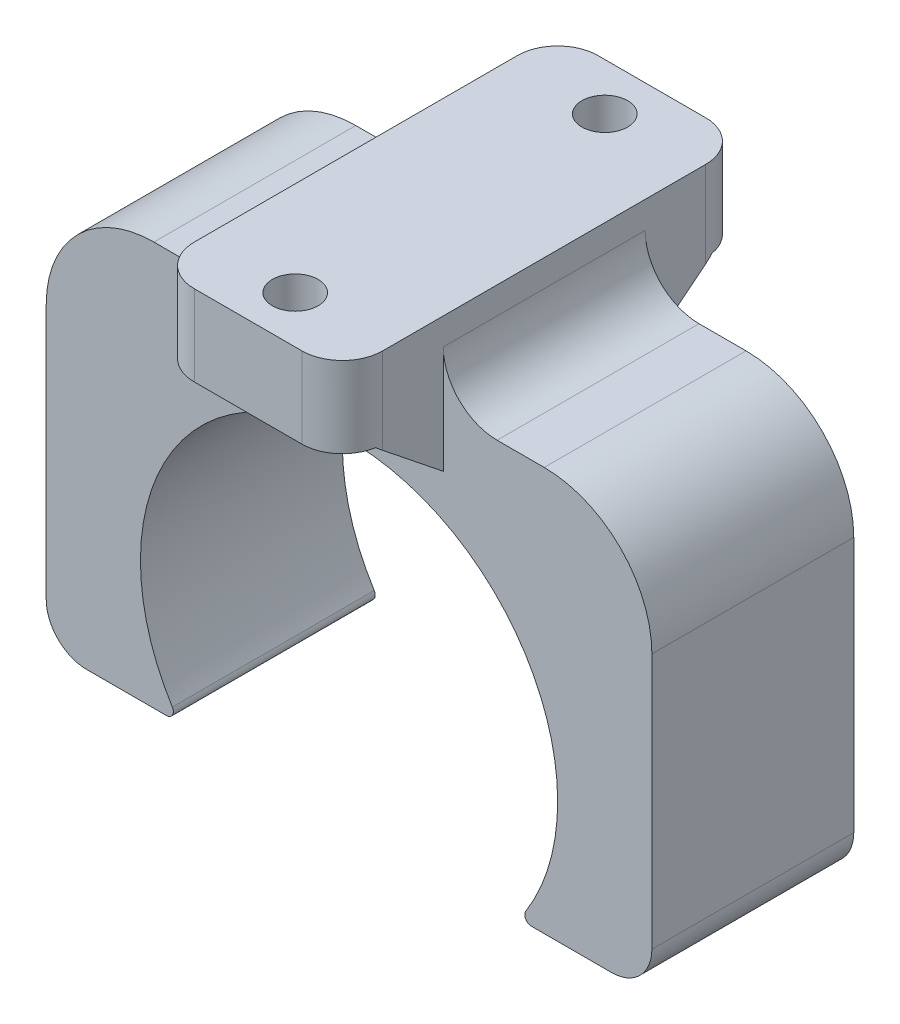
ISO-10303-21;
HEADER;
FILE_DESCRIPTION(('STEP AP214'),'2;1');
FILE_NAME('part.step','',(''),(''),'','','');
FILE_SCHEMA(('AUTOMOTIVE_DESIGN { 1 0 10303 214 1 1 1 1 }'));
ENDSEC;
DATA;
#1=APPLICATION_CONTEXT('core data for automotive mechanical design processes');
#2=APPLICATION_PROTOCOL_DEFINITION('international standard','automotive_design',2000,#1);
#3=PRODUCT_CONTEXT('',#1,'mechanical');
#4=PRODUCT('Part','Part','',(#3));
#5=PRODUCT_RELATED_PRODUCT_CATEGORY('part','',(#4));
#6=PRODUCT_DEFINITION_FORMATION('','',#4);
#7=PRODUCT_DEFINITION_CONTEXT('part definition',#1,'design');
#8=PRODUCT_DEFINITION('design','',#6,#7);
#9=PRODUCT_DEFINITION_SHAPE('','',#8);
#10=(LENGTH_UNIT() NAMED_UNIT(*) SI_UNIT(.MILLI.,.METRE.));
#11=(NAMED_UNIT(*) PLANE_ANGLE_UNIT() SI_UNIT($,.RADIAN.));
#12=(NAMED_UNIT(*) SI_UNIT($,.STERADIAN.) SOLID_ANGLE_UNIT());
#13=UNCERTAINTY_MEASURE_WITH_UNIT(LENGTH_MEASURE(1.E-05),#10,'distance_accuracy_value','');
#14=(GEOMETRIC_REPRESENTATION_CONTEXT(3) GLOBAL_UNCERTAINTY_ASSIGNED_CONTEXT((#13)) GLOBAL_UNIT_ASSIGNED_CONTEXT((#10,
#11,#12)) REPRESENTATION_CONTEXT('',''));
#15=CARTESIAN_POINT('',(0.,0.,0.));
#16=DIRECTION('',(0.,0.,1.));
#17=DIRECTION('',(1.,0.,0.));
#18=AXIS2_PLACEMENT_3D('',#15,#16,#17);
#19=CARTESIAN_POINT('',(-22.5,15.,7.5));
#20=DIRECTION('',(0.,-1.,0.));
#21=DIRECTION('',(0.,0.,-1.));
#22=AXIS2_PLACEMENT_3D('',#19,#20,#21);
#23=PLANE('',#22);
#24=DIRECTION('',(-1.,0.,0.));
#25=VECTOR('',#24,1.);
#26=CARTESIAN_POINT('',(-22.5,15.,-7.5));
#27=LINE('',#26,#25);
#28=CARTESIAN_POINT('',(14.5,15.,-7.5));
#29=VERTEX_POINT('',#28);
#30=CARTESIAN_POINT('',(11.,15.,-7.5));
#31=VERTEX_POINT('',#30);
#32=EDGE_CURVE('E410',#29,#31,#27,.T.);
#33=ORIENTED_EDGE('',*,*,#32,.T.);
#34=DIRECTION('',(0.,0.,-1.));
#35=VECTOR('',#34,1.);
#36=CARTESIAN_POINT('',(11.,15.,7.5));
#37=LINE('',#36,#35);
#38=CARTESIAN_POINT('',(11.,15.,7.5));
#39=VERTEX_POINT('',#38);
#40=EDGE_CURVE('E522',#31,#39,#37,.F.);
#41=ORIENTED_EDGE('',*,*,#40,.T.);
#42=DIRECTION('',(-1.,0.,0.));
#43=VECTOR('',#42,1.);
#44=CARTESIAN_POINT('',(-22.5,15.,7.5));
#45=LINE('',#44,#43);
#46=CARTESIAN_POINT('',(14.5,15.,7.5));
#47=VERTEX_POINT('',#46);
#48=EDGE_CURVE('E393',#47,#39,#45,.T.);
#49=ORIENTED_EDGE('',*,*,#48,.F.);
#50=DIRECTION('',(0.,0.,-1.));
#51=VECTOR('',#50,1.);
#52=CARTESIAN_POINT('',(14.5,15.,7.5));
#53=LINE('',#52,#51);
#54=EDGE_CURVE('E429',#47,#29,#53,.T.);
#55=ORIENTED_EDGE('',*,*,#54,.T.);
#56=EDGE_LOOP('',(#33,#41,#49,#55));
#57=FACE_BOUND('',#56,.T.);
#58=ADVANCED_FACE('F46',(#57),#23,.F.);
#59=CARTESIAN_POINT('',(-11.,15.,7.5));
#60=VERTEX_POINT('',#59);
#61=CARTESIAN_POINT('',(-14.5,15.,7.5));
#62=VERTEX_POINT('',#61);
#63=EDGE_CURVE('E391',#60,#62,#45,.T.);
#64=ORIENTED_EDGE('',*,*,#63,.F.);
#65=DIRECTION('',(0.,0.,1.));
#66=VECTOR('',#65,1.);
#67=CARTESIAN_POINT('',(-11.,15.,-7.5));
#68=LINE('',#67,#66);
#69=CARTESIAN_POINT('',(-11.,15.,-7.5));
#70=VERTEX_POINT('',#69);
#71=EDGE_CURVE('E535',#60,#70,#68,.F.);
#72=ORIENTED_EDGE('',*,*,#71,.T.);
#73=CARTESIAN_POINT('',(-14.5,15.,-7.5));
#74=VERTEX_POINT('',#73);
#75=EDGE_CURVE('E409',#70,#74,#27,.T.);
#76=ORIENTED_EDGE('',*,*,#75,.T.);
#77=DIRECTION('',(0.,0.,-1.));
#78=VECTOR('',#77,1.);
#79=CARTESIAN_POINT('',(-14.5,15.,7.5));
#80=LINE('',#79,#78);
#81=EDGE_CURVE('E425',#74,#62,#80,.F.);
#82=ORIENTED_EDGE('',*,*,#81,.T.);
#83=EDGE_LOOP('',(#64,#72,#76,#82));
#84=FACE_BOUND('',#83,.T.);
#85=ADVANCED_FACE('F683',(#84),#23,.F.);
#86=CARTESIAN_POINT('',(-22.5,-15.,7.5));
#87=DIRECTION('',(0.,1.,0.));
#88=DIRECTION('',(0.,0.,1.));
#89=AXIS2_PLACEMENT_3D('',#86,#87,#88);
#90=PLANE('',#89);
#91=DIRECTION('',(1.,0.,0.));
#92=VECTOR('',#91,1.);
#93=CARTESIAN_POINT('',(-22.5,-15.,-7.5));
#94=LINE('',#93,#92);
#95=CARTESIAN_POINT('',(-19.5,-15.,-7.5));
#96=VERTEX_POINT('',#95);
#97=CARTESIAN_POINT('',(-13.555441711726,-15.,-7.5));
#98=VERTEX_POINT('',#97);
#99=EDGE_CURVE('E392',#96,#98,#94,.T.);
#100=ORIENTED_EDGE('',*,*,#99,.T.);
#101=DIRECTION('',(0.,0.,1.));
#102=VECTOR('',#101,1.);
#103=CARTESIAN_POINT('',(-13.555441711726,-15.,7.5));
#104=LINE('',#103,#102);
#105=CARTESIAN_POINT('',(-13.555441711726,-15.,7.5));
#106=VERTEX_POINT('',#105);
#107=EDGE_CURVE('E483',#98,#106,#104,.T.);
#108=ORIENTED_EDGE('',*,*,#107,.T.);
#109=DIRECTION('',(1.,0.,0.));
#110=VECTOR('',#109,1.);
#111=CARTESIAN_POINT('',(-22.5,-15.,7.5));
#112=LINE('',#111,#110);
#113=CARTESIAN_POINT('',(-19.5,-15.,7.5));
#114=VERTEX_POINT('',#113);
#115=EDGE_CURVE('E402',#114,#106,#112,.T.);
#116=ORIENTED_EDGE('',*,*,#115,.F.);
#117=DIRECTION('',(0.,0.,-1.));
#118=VECTOR('',#117,1.);
#119=CARTESIAN_POINT('',(-19.5,-15.,7.5));
#120=LINE('',#119,#118);
#121=EDGE_CURVE('E476',#114,#96,#120,.T.);
#122=ORIENTED_EDGE('',*,*,#121,.T.);
#123=EDGE_LOOP('',(#100,#108,#116,#122));
#124=FACE_BOUND('',#123,.T.);
#125=ADVANCED_FACE('F702',(#124),#90,.F.);
#126=CARTESIAN_POINT('',(22.5,-15.,7.5));
#127=DIRECTION('',(-1.,0.,0.));
#128=DIRECTION('',(0.,0.,1.));
#129=AXIS2_PLACEMENT_3D('',#126,#127,#128);
#130=PLANE('',#129);
#131=DIRECTION('',(0.,1.,0.));
#132=VECTOR('',#131,1.);
#133=CARTESIAN_POINT('',(22.5,-15.,7.5));
#134=LINE('',#133,#132);
#135=CARTESIAN_POINT('',(22.5,-12.,7.5));
#136=VERTEX_POINT('',#135);
#137=CARTESIAN_POINT('',(22.5,7.,7.5));
#138=VERTEX_POINT('',#137);
#139=EDGE_CURVE('E388',#136,#138,#134,.T.);
#140=ORIENTED_EDGE('',*,*,#139,.F.);
#141=DIRECTION('',(0.,0.,-1.));
#142=VECTOR('',#141,1.);
#143=CARTESIAN_POINT('',(22.5,-12.,7.5));
#144=LINE('',#143,#142);
#145=CARTESIAN_POINT('',(22.5,-12.,-7.5));
#146=VERTEX_POINT('',#145);
#147=EDGE_CURVE('E455',#136,#146,#144,.T.);
#148=ORIENTED_EDGE('',*,*,#147,.T.);
#149=DIRECTION('',(0.,1.,0.));
#150=VECTOR('',#149,1.);
#151=CARTESIAN_POINT('',(22.5,-15.,-7.5));
#152=LINE('',#151,#150);
#153=CARTESIAN_POINT('',(22.5,7.,-7.5));
#154=VERTEX_POINT('',#153);
#155=EDGE_CURVE('E387',#146,#154,#152,.T.);
#156=ORIENTED_EDGE('',*,*,#155,.T.);
#157=DIRECTION('',(0.,0.,-1.));
#158=VECTOR('',#157,1.);
#159=CARTESIAN_POINT('',(22.5,7.,7.5));
#160=LINE('',#159,#158);
#161=EDGE_CURVE('E441',#154,#138,#160,.F.);
#162=ORIENTED_EDGE('',*,*,#161,.T.);
#163=EDGE_LOOP('',(#140,#148,#156,#162));
#164=FACE_BOUND('',#163,.T.);
#165=ADVANCED_FACE('F732',(#164),#130,.F.);
#166=CARTESIAN_POINT('',(-22.5,-15.,7.5));
#167=DIRECTION('',(1.,0.,0.));
#168=DIRECTION('',(0.,0.,-1.));
#169=AXIS2_PLACEMENT_3D('',#166,#167,#168);
#170=PLANE('',#169);
#171=DIRECTION('',(0.,-1.,0.));
#172=VECTOR('',#171,1.);
#173=CARTESIAN_POINT('',(-22.5,-15.,-7.5));
#174=LINE('',#173,#172);
#175=CARTESIAN_POINT('',(-22.5,7.,-7.5));
#176=VERTEX_POINT('',#175);
#177=CARTESIAN_POINT('',(-22.5,-12.,-7.5));
#178=VERTEX_POINT('',#177);
#179=EDGE_CURVE('E414',#176,#178,#174,.T.);
#180=ORIENTED_EDGE('',*,*,#179,.T.);
#181=DIRECTION('',(0.,0.,-1.));
#182=VECTOR('',#181,1.);
#183=CARTESIAN_POINT('',(-22.5,-12.,7.5));
#184=LINE('',#183,#182);
#185=CARTESIAN_POINT('',(-22.5,-12.,7.5));
#186=VERTEX_POINT('',#185);
#187=EDGE_CURVE('E480',#178,#186,#184,.F.);
#188=ORIENTED_EDGE('',*,*,#187,.T.);
#189=DIRECTION('',(0.,-1.,0.));
#190=VECTOR('',#189,1.);
#191=CARTESIAN_POINT('',(-22.5,-15.,7.5));
#192=LINE('',#191,#190);
#193=CARTESIAN_POINT('',(-22.5,7.,7.5));
#194=VERTEX_POINT('',#193);
#195=EDGE_CURVE('E397',#194,#186,#192,.T.);
#196=ORIENTED_EDGE('',*,*,#195,.F.);
#197=DIRECTION('',(0.,0.,-1.));
#198=VECTOR('',#197,1.);
#199=CARTESIAN_POINT('',(-22.5,7.,7.5));
#200=LINE('',#199,#198);
#201=EDGE_CURVE('E451',#194,#176,#200,.T.);
#202=ORIENTED_EDGE('',*,*,#201,.T.);
#203=EDGE_LOOP('',(#180,#188,#196,#202));
#204=FACE_BOUND('',#203,.T.);
#205=ADVANCED_FACE('F695',(#204),#170,.F.);
#206=CARTESIAN_POINT('',(13.5554417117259,-15.,7.5));
#207=VERTEX_POINT('',#206);
#208=CARTESIAN_POINT('',(19.5,-15.,7.5));
#209=VERTEX_POINT('',#208);
#210=EDGE_CURVE('E401',#207,#209,#112,.T.);
#211=ORIENTED_EDGE('',*,*,#210,.F.);
#212=DIRECTION('',(0.,0.,1.));
#213=VECTOR('',#212,1.);
#214=CARTESIAN_POINT('',(13.555441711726,-15.,7.5));
#215=LINE('',#214,#213);
#216=CARTESIAN_POINT('',(13.5554417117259,-15.,-7.5));
#217=VERTEX_POINT('',#216);
#218=EDGE_CURVE('E507',#207,#217,#215,.F.);
#219=ORIENTED_EDGE('',*,*,#218,.T.);
#220=CARTESIAN_POINT('',(19.5,-15.,-7.5));
#221=VERTEX_POINT('',#220);
#222=EDGE_CURVE('E419',#217,#221,#94,.T.);
#223=ORIENTED_EDGE('',*,*,#222,.T.);
#224=DIRECTION('',(0.,0.,-1.));
#225=VECTOR('',#224,1.);
#226=CARTESIAN_POINT('',(19.5,-15.,7.5));
#227=LINE('',#226,#225);
#228=EDGE_CURVE('E466',#221,#209,#227,.F.);
#229=ORIENTED_EDGE('',*,*,#228,.T.);
#230=EDGE_LOOP('',(#211,#219,#223,#229));
#231=FACE_BOUND('',#230,.T.);
#232=ADVANCED_FACE('F719',(#231),#90,.F.);
#233=CARTESIAN_POINT('',(0.,0.,7.5));
#234=DIRECTION('',(0.,0.,-1.));
#235=DIRECTION('',(-1.,0.,0.));
#236=AXIS2_PLACEMENT_3D('',#233,#234,#235);
#237=PLANE('',#236);
#238=CARTESIAN_POINT('',(-13.555441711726,-14.5,7.5));
#239=DIRECTION('',(0.,0.,-1.));
#240=DIRECTION('',(-1.,0.,0.));
#241=AXIS2_PLACEMENT_3D('',#238,#239,#240);
#242=CIRCLE('',#241,0.5);
#243=CARTESIAN_POINT('',(-13.1318341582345,-14.234375,7.5));
#244=VERTEX_POINT('',#243);
#245=EDGE_CURVE('E490',#106,#244,#242,.F.);
#246=ORIENTED_EDGE('',*,*,#245,.T.);
#247=CARTESIAN_POINT('',(0.,-6.,7.5));
#248=DIRECTION('',(0.,0.,1.));
#249=DIRECTION('',(1.,0.,0.));
#250=AXIS2_PLACEMENT_3D('',#247,#248,#249);
#251=CIRCLE('',#250,15.5);
#252=CARTESIAN_POINT('',(13.1318341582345,-14.234375,7.5));
#253=VERTEX_POINT('',#252);
#254=EDGE_CURVE('E384',#253,#244,#251,.T.);
#255=ORIENTED_EDGE('',*,*,#254,.F.);
#256=CARTESIAN_POINT('',(13.555441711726,-14.5,7.5));
#257=DIRECTION('',(0.,0.,-1.));
#258=DIRECTION('',(-1.,0.,0.));
#259=AXIS2_PLACEMENT_3D('',#256,#257,#258);
#260=CIRCLE('',#259,0.5);
#261=EDGE_CURVE('E487',#253,#207,#260,.F.);
#262=ORIENTED_EDGE('',*,*,#261,.T.);
#263=ORIENTED_EDGE('',*,*,#210,.T.);
#264=CARTESIAN_POINT('',(19.5,-12.,7.5));
#265=DIRECTION('',(0.,0.,-1.));
#266=DIRECTION('',(-1.,0.,0.));
#267=AXIS2_PLACEMENT_3D('',#264,#265,#266);
#268=CIRCLE('',#267,3.);
#269=EDGE_CURVE('E473',#209,#136,#268,.F.);
#270=ORIENTED_EDGE('',*,*,#269,.T.);
#271=ORIENTED_EDGE('',*,*,#139,.T.);
#272=CARTESIAN_POINT('',(14.5,7.,7.5));
#273=DIRECTION('',(0.,0.,-1.));
#274=DIRECTION('',(-1.,0.,0.));
#275=AXIS2_PLACEMENT_3D('',#272,#273,#274);
#276=CIRCLE('',#275,8.);
#277=EDGE_CURVE('E448',#138,#47,#276,.F.);
#278=ORIENTED_EDGE('',*,*,#277,.T.);
#279=ORIENTED_EDGE('',*,*,#48,.T.);
#280=CARTESIAN_POINT('',(11.,19.,7.5));
#281=DIRECTION('',(0.,0.,-1.));
#282=DIRECTION('',(-1.,0.,0.));
#283=AXIS2_PLACEMENT_3D('',#280,#281,#282);
#284=CIRCLE('',#283,4.);
#285=CARTESIAN_POINT('',(7.,19.,7.5));
#286=VERTEX_POINT('',#285);
#287=EDGE_CURVE('E541',#39,#286,#284,.T.);
#288=ORIENTED_EDGE('',*,*,#287,.T.);
#289=DIRECTION('',(0.,1.,0.));
#290=VECTOR('',#289,1.);
#291=CARTESIAN_POINT('',(7.,0.,7.5));
#292=LINE('',#291,#290);
#293=CARTESIAN_POINT('',(7.,11.,7.5));
#294=VERTEX_POINT('',#293);
#295=EDGE_CURVE('E511',#294,#286,#292,.T.);
#296=ORIENTED_EDGE('',*,*,#295,.F.);
#297=DIRECTION('',(-1.,0.,0.));
#298=VECTOR('',#297,1.);
#299=CARTESIAN_POINT('',(0.,11.,7.5));
#300=LINE('',#299,#298);
#301=CARTESIAN_POINT('',(5.,11.,7.5));
#302=VERTEX_POINT('',#301);
#303=EDGE_CURVE('E352',#294,#302,#300,.T.);
#304=ORIENTED_EDGE('',*,*,#303,.T.);
#305=DIRECTION('',(0.,-1.,0.));
#306=VECTOR('',#305,1.);
#307=CARTESIAN_POINT('',(5.,0.,7.5));
#308=LINE('',#307,#306);
#309=CARTESIAN_POINT('',(5.,15.,7.5));
#310=VERTEX_POINT('',#309);
#311=EDGE_CURVE('E346',#310,#302,#308,.T.);
#312=ORIENTED_EDGE('',*,*,#311,.F.);
#313=DIRECTION('',(-1.,0.,0.));
#314=VECTOR('',#313,1.);
#315=CARTESIAN_POINT('',(0.,15.,7.5));
#316=LINE('',#315,#314);
#317=CARTESIAN_POINT('',(-5.,15.,7.5));
#318=VERTEX_POINT('',#317);
#319=EDGE_CURVE('E374',#310,#318,#316,.T.);
#320=ORIENTED_EDGE('',*,*,#319,.T.);
#321=DIRECTION('',(0.,1.,0.));
#322=VECTOR('',#321,1.);
#323=CARTESIAN_POINT('',(-5.,0.,7.5));
#324=LINE('',#323,#322);
#325=CARTESIAN_POINT('',(-5.,11.,7.5));
#326=VERTEX_POINT('',#325);
#327=EDGE_CURVE('E306',#326,#318,#324,.T.);
#328=ORIENTED_EDGE('',*,*,#327,.F.);
#329=DIRECTION('',(1.,0.,0.));
#330=VECTOR('',#329,1.);
#331=CARTESIAN_POINT('',(0.,11.,7.5));
#332=LINE('',#331,#330);
#333=CARTESIAN_POINT('',(-7.,11.,7.5));
#334=VERTEX_POINT('',#333);
#335=EDGE_CURVE('E313',#326,#334,#332,.F.);
#336=ORIENTED_EDGE('',*,*,#335,.T.);
#337=DIRECTION('',(0.,-1.,0.));
#338=VECTOR('',#337,1.);
#339=CARTESIAN_POINT('',(-7.,0.,7.5));
#340=LINE('',#339,#338);
#341=CARTESIAN_POINT('',(-7.,19.,7.5));
#342=VERTEX_POINT('',#341);
#343=EDGE_CURVE('E531',#342,#334,#340,.T.);
#344=ORIENTED_EDGE('',*,*,#343,.F.);
#345=CARTESIAN_POINT('',(-11.,19.,7.5));
#346=DIRECTION('',(0.,0.,-1.));
#347=DIRECTION('',(-1.,0.,0.));
#348=AXIS2_PLACEMENT_3D('',#345,#346,#347);
#349=CIRCLE('',#348,4.);
#350=EDGE_CURVE('E545',#342,#60,#349,.T.);
#351=ORIENTED_EDGE('',*,*,#350,.T.);
#352=ORIENTED_EDGE('',*,*,#63,.T.);
#353=CARTESIAN_POINT('',(-14.5,7.,7.5));
#354=DIRECTION('',(0.,0.,-1.));
#355=DIRECTION('',(-1.,0.,0.));
#356=AXIS2_PLACEMENT_3D('',#353,#354,#355);
#357=CIRCLE('',#356,8.);
#358=EDGE_CURVE('E445',#62,#194,#357,.F.);
#359=ORIENTED_EDGE('',*,*,#358,.T.);
#360=ORIENTED_EDGE('',*,*,#195,.T.);
#361=CARTESIAN_POINT('',(-19.5,-12.,7.5));
#362=DIRECTION('',(0.,0.,-1.));
#363=DIRECTION('',(-1.,0.,0.));
#364=AXIS2_PLACEMENT_3D('',#361,#362,#363);
#365=CIRCLE('',#364,3.);
#366=EDGE_CURVE('E470',#186,#114,#365,.F.);
#367=ORIENTED_EDGE('',*,*,#366,.T.);
#368=ORIENTED_EDGE('',*,*,#115,.T.);
#369=EDGE_LOOP('',(#246,#255,#262,#263,#270,#271,#278,#279,#288,#296,#304,#312,#320,#328,#336,
#344,#351,#352,#359,#360,#367,#368));
#370=FACE_BOUND('',#369,.T.);
#371=ADVANCED_FACE('F667',(#370),#237,.F.);
#372=CARTESIAN_POINT('',(0.,0.,-7.5));
#373=DIRECTION('',(0.,0.,-1.));
#374=DIRECTION('',(-1.,0.,0.));
#375=AXIS2_PLACEMENT_3D('',#372,#373,#374);
#376=PLANE('',#375);
#377=DIRECTION('',(0.,1.,0.));
#378=VECTOR('',#377,1.);
#379=CARTESIAN_POINT('',(-7.,21.,-7.5));
#380=LINE('',#379,#378);
#381=CARTESIAN_POINT('',(-7.,11.,-7.5));
#382=VERTEX_POINT('',#381);
#383=CARTESIAN_POINT('',(-7.,19.,-7.5));
#384=VERTEX_POINT('',#383);
#385=EDGE_CURVE('E290',#382,#384,#380,.T.);
#386=ORIENTED_EDGE('',*,*,#385,.F.);
#387=DIRECTION('',(-1.,0.,0.));
#388=VECTOR('',#387,1.);
#389=CARTESIAN_POINT('',(0.,11.,-7.5));
#390=LINE('',#389,#388);
#391=CARTESIAN_POINT('',(-5.,11.,-7.5));
#392=VERTEX_POINT('',#391);
#393=EDGE_CURVE('E278',#392,#382,#390,.T.);
#394=ORIENTED_EDGE('',*,*,#393,.F.);
#395=DIRECTION('',(0.,1.,0.));
#396=VECTOR('',#395,1.);
#397=CARTESIAN_POINT('',(-5.,0.,-7.5));
#398=LINE('',#397,#396);
#399=CARTESIAN_POINT('',(-5.,15.,-7.5));
#400=VERTEX_POINT('',#399);
#401=EDGE_CURVE('E267',#392,#400,#398,.T.);
#402=ORIENTED_EDGE('',*,*,#401,.T.);
#403=CARTESIAN_POINT('',(4.99999999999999,15.,-7.5));
#404=VERTEX_POINT('',#403);
#405=EDGE_CURVE('E415',#404,#400,#27,.T.);
#406=ORIENTED_EDGE('',*,*,#405,.F.);
#407=DIRECTION('',(0.,-1.,0.));
#408=VECTOR('',#407,1.);
#409=CARTESIAN_POINT('',(5.,0.,-7.5));
#410=LINE('',#409,#408);
#411=CARTESIAN_POINT('',(5.,11.,-7.5));
#412=VERTEX_POINT('',#411);
#413=EDGE_CURVE('E328',#404,#412,#410,.T.);
#414=ORIENTED_EDGE('',*,*,#413,.T.);
#415=DIRECTION('',(1.,0.,0.));
#416=VECTOR('',#415,1.);
#417=CARTESIAN_POINT('',(0.,11.,-7.5));
#418=LINE('',#417,#416);
#419=CARTESIAN_POINT('',(7.,11.,-7.5));
#420=VERTEX_POINT('',#419);
#421=EDGE_CURVE('E332',#420,#412,#418,.F.);
#422=ORIENTED_EDGE('',*,*,#421,.F.);
#423=DIRECTION('',(0.,-1.,0.));
#424=VECTOR('',#423,1.);
#425=CARTESIAN_POINT('',(7.,21.,-7.5));
#426=LINE('',#425,#424);
#427=CARTESIAN_POINT('',(7.,19.,-7.5));
#428=VERTEX_POINT('',#427);
#429=EDGE_CURVE('E518',#428,#420,#426,.T.);
#430=ORIENTED_EDGE('',*,*,#429,.F.);
#431=CARTESIAN_POINT('',(11.,19.,-7.5));
#432=DIRECTION('',(0.,0.,-1.));
#433=DIRECTION('',(-1.,0.,0.));
#434=AXIS2_PLACEMENT_3D('',#431,#432,#433);
#435=CIRCLE('',#434,4.);
#436=EDGE_CURVE('E538',#428,#31,#435,.F.);
#437=ORIENTED_EDGE('',*,*,#436,.T.);
#438=ORIENTED_EDGE('',*,*,#32,.F.);
#439=CARTESIAN_POINT('',(14.5,7.,-7.5));
#440=DIRECTION('',(0.,0.,-1.));
#441=DIRECTION('',(-1.,0.,0.));
#442=AXIS2_PLACEMENT_3D('',#439,#440,#441);
#443=CIRCLE('',#442,8.);
#444=EDGE_CURVE('E437',#29,#154,#443,.T.);
#445=ORIENTED_EDGE('',*,*,#444,.T.);
#446=ORIENTED_EDGE('',*,*,#155,.F.);
#447=CARTESIAN_POINT('',(19.5,-12.,-7.5));
#448=DIRECTION('',(0.,0.,-1.));
#449=DIRECTION('',(-1.,0.,0.));
#450=AXIS2_PLACEMENT_3D('',#447,#448,#449);
#451=CIRCLE('',#450,3.);
#452=EDGE_CURVE('E462',#146,#221,#451,.T.);
#453=ORIENTED_EDGE('',*,*,#452,.T.);
#454=ORIENTED_EDGE('',*,*,#222,.F.);
#455=CARTESIAN_POINT('',(13.555441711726,-14.5,-7.5));
#456=DIRECTION('',(0.,0.,-1.));
#457=DIRECTION('',(-1.,0.,0.));
#458=AXIS2_PLACEMENT_3D('',#455,#456,#457);
#459=CIRCLE('',#458,0.5);
#460=CARTESIAN_POINT('',(13.1318341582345,-14.234375,-7.5));
#461=VERTEX_POINT('',#460);
#462=EDGE_CURVE('E500',#217,#461,#459,.T.);
#463=ORIENTED_EDGE('',*,*,#462,.T.);
#464=CARTESIAN_POINT('',(0.,-6.,-7.5));
#465=DIRECTION('',(0.,0.,-1.));
#466=DIRECTION('',(-1.,0.,0.));
#467=AXIS2_PLACEMENT_3D('',#464,#465,#466);
#468=CIRCLE('',#467,15.5);
#469=CARTESIAN_POINT('',(-13.1318341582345,-14.234375,-7.5));
#470=VERTEX_POINT('',#469);
#471=EDGE_CURVE('E406',#470,#461,#468,.T.);
#472=ORIENTED_EDGE('',*,*,#471,.F.);
#473=CARTESIAN_POINT('',(-13.555441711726,-14.5,-7.5));
#474=DIRECTION('',(0.,0.,-1.));
#475=DIRECTION('',(-1.,0.,0.));
#476=AXIS2_PLACEMENT_3D('',#473,#474,#475);
#477=CIRCLE('',#476,0.5);
#478=EDGE_CURVE('E504',#470,#98,#477,.T.);
#479=ORIENTED_EDGE('',*,*,#478,.T.);
#480=ORIENTED_EDGE('',*,*,#99,.F.);
#481=CARTESIAN_POINT('',(-19.5,-12.,-7.5));
#482=DIRECTION('',(0.,0.,-1.));
#483=DIRECTION('',(-1.,0.,0.));
#484=AXIS2_PLACEMENT_3D('',#481,#482,#483);
#485=CIRCLE('',#484,3.);
#486=EDGE_CURVE('E459',#96,#178,#485,.T.);
#487=ORIENTED_EDGE('',*,*,#486,.T.);
#488=ORIENTED_EDGE('',*,*,#179,.F.);
#489=CARTESIAN_POINT('',(-14.5,7.,-7.5));
#490=DIRECTION('',(0.,0.,-1.));
#491=DIRECTION('',(-1.,0.,0.));
#492=AXIS2_PLACEMENT_3D('',#489,#490,#491);
#493=CIRCLE('',#492,8.);
#494=EDGE_CURVE('E433',#176,#74,#493,.T.);
#495=ORIENTED_EDGE('',*,*,#494,.T.);
#496=ORIENTED_EDGE('',*,*,#75,.F.);
#497=CARTESIAN_POINT('',(-11.,19.,-7.5));
#498=DIRECTION('',(0.,0.,-1.));
#499=DIRECTION('',(-1.,0.,0.));
#500=AXIS2_PLACEMENT_3D('',#497,#498,#499);
#501=CIRCLE('',#500,4.);
#502=EDGE_CURVE('E548',#70,#384,#501,.F.);
#503=ORIENTED_EDGE('',*,*,#502,.T.);
#504=EDGE_LOOP('',(#386,#394,#402,#406,#414,#422,#430,#437,#438,#445,#446,#453,#454,#463,#472,
#479,#480,#487,#488,#495,#496,#503));
#505=FACE_BOUND('',#504,.T.);
#506=ADVANCED_FACE('F288',(#505),#376,.T.);
#507=CARTESIAN_POINT('',(0.,-6.,-51.3406204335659));
#508=DIRECTION('',(0.,0.,1.));
#509=DIRECTION('',(1.,0.,0.));
#510=AXIS2_PLACEMENT_3D('',#507,#508,#509);
#511=CYLINDRICAL_SURFACE('',#510,15.5);
#512=ORIENTED_EDGE('',*,*,#254,.T.);
#513=DIRECTION('',(0.,0.,1.));
#514=VECTOR('',#513,1.);
#515=CARTESIAN_POINT('',(-13.1318341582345,-14.234375,-51.3406204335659));
#516=LINE('',#515,#514);
#517=EDGE_CURVE('E497',#244,#470,#516,.F.);
#518=ORIENTED_EDGE('',*,*,#517,.T.);
#519=ORIENTED_EDGE('',*,*,#471,.T.);
#520=DIRECTION('',(0.,0.,1.));
#521=VECTOR('',#520,1.);
#522=CARTESIAN_POINT('',(13.1318341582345,-14.234375,-51.3406204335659));
#523=LINE('',#522,#521);
#524=EDGE_CURVE('E494',#461,#253,#523,.T.);
#525=ORIENTED_EDGE('',*,*,#524,.T.);
#526=EDGE_LOOP('',(#512,#518,#519,#525));
#527=FACE_BOUND('',#526,.T.);
#528=ADVANCED_FACE('F752',(#527),#511,.F.);
#529=CARTESIAN_POINT('',(14.5,7.,7.5));
#530=DIRECTION('',(0.,0.,-1.));
#531=DIRECTION('',(-1.,0.,0.));
#532=AXIS2_PLACEMENT_3D('',#529,#530,#531);
#533=CYLINDRICAL_SURFACE('',#532,8.);
#534=ORIENTED_EDGE('',*,*,#277,.F.);
#535=ORIENTED_EDGE('',*,*,#161,.F.);
#536=ORIENTED_EDGE('',*,*,#444,.F.);
#537=ORIENTED_EDGE('',*,*,#54,.F.);
#538=EDGE_LOOP('',(#534,#535,#536,#537));
#539=FACE_BOUND('',#538,.T.);
#540=ADVANCED_FACE('F737',(#539),#533,.T.);
#541=CARTESIAN_POINT('',(-14.5,7.,7.5));
#542=DIRECTION('',(0.,0.,-1.));
#543=DIRECTION('',(-1.,0.,0.));
#544=AXIS2_PLACEMENT_3D('',#541,#542,#543);
#545=CYLINDRICAL_SURFACE('',#544,8.);
#546=ORIENTED_EDGE('',*,*,#358,.F.);
#547=ORIENTED_EDGE('',*,*,#81,.F.);
#548=ORIENTED_EDGE('',*,*,#494,.F.);
#549=ORIENTED_EDGE('',*,*,#201,.F.);
#550=EDGE_LOOP('',(#546,#547,#548,#549));
#551=FACE_BOUND('',#550,.T.);
#552=ADVANCED_FACE('F691',(#551),#545,.T.);
#553=CARTESIAN_POINT('',(19.5,-12.,7.5));
#554=DIRECTION('',(0.,0.,-1.));
#555=DIRECTION('',(-1.,0.,0.));
#556=AXIS2_PLACEMENT_3D('',#553,#554,#555);
#557=CYLINDRICAL_SURFACE('',#556,3.);
#558=ORIENTED_EDGE('',*,*,#269,.F.);
#559=ORIENTED_EDGE('',*,*,#228,.F.);
#560=ORIENTED_EDGE('',*,*,#452,.F.);
#561=ORIENTED_EDGE('',*,*,#147,.F.);
#562=EDGE_LOOP('',(#558,#559,#560,#561));
#563=FACE_BOUND('',#562,.T.);
#564=ADVANCED_FACE('F730',(#563),#557,.T.);
#565=CARTESIAN_POINT('',(-19.5,-12.,7.5));
#566=DIRECTION('',(0.,0.,-1.));
#567=DIRECTION('',(-1.,0.,0.));
#568=AXIS2_PLACEMENT_3D('',#565,#566,#567);
#569=CYLINDRICAL_SURFACE('',#568,3.);
#570=ORIENTED_EDGE('',*,*,#366,.F.);
#571=ORIENTED_EDGE('',*,*,#187,.F.);
#572=ORIENTED_EDGE('',*,*,#486,.F.);
#573=ORIENTED_EDGE('',*,*,#121,.F.);
#574=EDGE_LOOP('',(#570,#571,#572,#573));
#575=FACE_BOUND('',#574,.T.);
#576=ADVANCED_FACE('F698',(#575),#569,.T.);
#577=CARTESIAN_POINT('',(-13.555441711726,-14.5,-51.3406204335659));
#578=DIRECTION('',(0.,0.,1.));
#579=DIRECTION('',(1.,0.,0.));
#580=AXIS2_PLACEMENT_3D('',#577,#578,#579);
#581=CYLINDRICAL_SURFACE('',#580,0.5);
#582=ORIENTED_EDGE('',*,*,#478,.F.);
#583=ORIENTED_EDGE('',*,*,#517,.F.);
#584=ORIENTED_EDGE('',*,*,#245,.F.);
#585=ORIENTED_EDGE('',*,*,#107,.F.);
#586=EDGE_LOOP('',(#582,#583,#584,#585));
#587=FACE_BOUND('',#586,.T.);
#588=ADVANCED_FACE('F707',(#587),#581,.T.);
#589=CARTESIAN_POINT('',(13.555441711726,-14.5,-51.3406204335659));
#590=DIRECTION('',(0.,0.,1.));
#591=DIRECTION('',(1.,0.,0.));
#592=AXIS2_PLACEMENT_3D('',#589,#590,#591);
#593=CYLINDRICAL_SURFACE('',#592,0.5);
#594=ORIENTED_EDGE('',*,*,#261,.F.);
#595=ORIENTED_EDGE('',*,*,#524,.F.);
#596=ORIENTED_EDGE('',*,*,#462,.F.);
#597=ORIENTED_EDGE('',*,*,#218,.F.);
#598=EDGE_LOOP('',(#594,#595,#596,#597));
#599=FACE_BOUND('',#598,.T.);
#600=ADVANCED_FACE('F716',(#599),#593,.T.);
#601=CARTESIAN_POINT('',(0.,15.,0.));
#602=DIRECTION('',(0.,-1.,0.));
#603=DIRECTION('',(0.,0.,-1.));
#604=AXIS2_PLACEMENT_3D('',#601,#602,#603);
#605=PLANE('',#604);
#606=CARTESIAN_POINT('',(0.,15.,11.5));
#607=DIRECTION('',(0.,-1.,0.));
#608=DIRECTION('',(0.,0.,-1.));
#609=AXIS2_PLACEMENT_3D('',#606,#607,#608);
#610=CIRCLE('',#609,1.7);
#611=CARTESIAN_POINT('',(0.,15.,9.8));
#612=VERTEX_POINT('',#611);
#613=EDGE_CURVE('E1158',#612,#612,#610,.T.);
#614=ORIENTED_EDGE('',*,*,#613,.F.);
#615=EDGE_LOOP('',(#614));
#616=FACE_BOUND('',#615,.T.);
#617=DIRECTION('',(-1.,0.,0.));
#618=VECTOR('',#617,1.);
#619=CARTESIAN_POINT('',(0.,15.,12.5));
#620=LINE('',#619,#618);
#621=CARTESIAN_POINT('',(6.95803989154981,15.,12.5));
#622=VERTEX_POINT('',#621);
#623=CARTESIAN_POINT('',(5.,15.,12.5));
#624=VERTEX_POINT('',#623);
#625=EDGE_CURVE('E349',#622,#624,#620,.T.);
#626=ORIENTED_EDGE('',*,*,#625,.F.);
#627=CARTESIAN_POINT('',(4.,15.,12.));
#628=DIRECTION('',(0.,-1.,0.));
#629=DIRECTION('',(0.,0.,-1.));
#630=AXIS2_PLACEMENT_3D('',#627,#628,#629);
#631=CIRCLE('',#630,3.);
#632=CARTESIAN_POINT('',(4.,15.,15.));
#633=VERTEX_POINT('',#632);
#634=EDGE_CURVE('E569',#622,#633,#631,.T.);
#635=ORIENTED_EDGE('',*,*,#634,.T.);
#636=DIRECTION('',(1.,0.,0.));
#637=VECTOR('',#636,1.);
#638=CARTESIAN_POINT('',(-7.,15.,15.));
#639=LINE('',#638,#637);
#640=CARTESIAN_POINT('',(-4.,15.,15.));
#641=VERTEX_POINT('',#640);
#642=EDGE_CURVE('E362',#641,#633,#639,.T.);
#643=ORIENTED_EDGE('',*,*,#642,.F.);
#644=CARTESIAN_POINT('',(-4.,15.,12.));
#645=DIRECTION('',(0.,-1.,0.));
#646=DIRECTION('',(0.,0.,-1.));
#647=AXIS2_PLACEMENT_3D('',#644,#645,#646);
#648=CIRCLE('',#647,3.);
#649=CARTESIAN_POINT('',(-6.95803989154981,15.,12.5));
#650=VERTEX_POINT('',#649);
#651=EDGE_CURVE('E566',#641,#650,#648,.T.);
#652=ORIENTED_EDGE('',*,*,#651,.T.);
#653=DIRECTION('',(1.,0.,0.));
#654=VECTOR('',#653,1.);
#655=CARTESIAN_POINT('',(0.,15.,12.5));
#656=LINE('',#655,#654);
#657=CARTESIAN_POINT('',(-5.,15.,12.5));
#658=VERTEX_POINT('',#657);
#659=EDGE_CURVE('E309',#658,#650,#656,.F.);
#660=ORIENTED_EDGE('',*,*,#659,.F.);
#661=DIRECTION('',(0.,0.,-1.));
#662=VECTOR('',#661,1.);
#663=CARTESIAN_POINT('',(-5.,15.,0.));
#664=LINE('',#663,#662);
#665=EDGE_CURVE('E301',#658,#318,#664,.T.);
#666=ORIENTED_EDGE('',*,*,#665,.T.);
#667=ORIENTED_EDGE('',*,*,#319,.F.);
#668=DIRECTION('',(0.,0.,1.));
#669=VECTOR('',#668,1.);
#670=CARTESIAN_POINT('',(5.,15.,0.));
#671=LINE('',#670,#669);
#672=EDGE_CURVE('E339',#310,#624,#671,.T.);
#673=ORIENTED_EDGE('',*,*,#672,.T.);
#674=EDGE_LOOP('',(#626,#635,#643,#652,#660,#666,#667,#673));
#675=FACE_BOUND('',#674,.T.);
#676=ADVANCED_FACE('F763',(#616,#675),#605,.T.);
#677=CARTESIAN_POINT('',(7.,21.,15.));
#678=DIRECTION('',(-1.,0.,0.));
#679=DIRECTION('',(0.,0.,1.));
#680=AXIS2_PLACEMENT_3D('',#677,#678,#679);
#681=PLANE('',#680);
#682=DIRECTION('',(0.,0.,-1.));
#683=VECTOR('',#682,1.);
#684=CARTESIAN_POINT('',(7.,21.,15.));
#685=LINE('',#684,#683);
#686=CARTESIAN_POINT('',(7.,21.,12.));
#687=VERTEX_POINT('',#686);
#688=CARTESIAN_POINT('',(7.,21.,-12.));
#689=VERTEX_POINT('',#688);
#690=EDGE_CURVE('E357',#687,#689,#685,.T.);
#691=ORIENTED_EDGE('',*,*,#690,.F.);
#692=DIRECTION('',(0.,-1.,0.));
#693=VECTOR('',#692,1.);
#694=CARTESIAN_POINT('',(7.,21.,12.));
#695=LINE('',#694,#693);
#696=CARTESIAN_POINT('',(7.,14.6,12.));
#697=VERTEX_POINT('',#696);
#698=EDGE_CURVE('E559',#687,#697,#695,.T.);
#699=ORIENTED_EDGE('',*,*,#698,.T.);
#700=DIRECTION('',(0.,-0.624695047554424,-0.78086880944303));
#701=VECTOR('',#700,1.);
#702=CARTESIAN_POINT('',(7.,15.,12.5));
#703=LINE('',#702,#701);
#704=EDGE_CURVE('E336',#697,#294,#703,.T.);
#705=ORIENTED_EDGE('',*,*,#704,.T.);
#706=ORIENTED_EDGE('',*,*,#295,.T.);
#707=DIRECTION('',(0.,0.,-1.));
#708=VECTOR('',#707,1.);
#709=CARTESIAN_POINT('',(7.,19.,-7.5));
#710=LINE('',#709,#708);
#711=EDGE_CURVE('E514',#286,#428,#710,.T.);
#712=ORIENTED_EDGE('',*,*,#711,.T.);
#713=ORIENTED_EDGE('',*,*,#429,.T.);
#714=DIRECTION('',(0.,-0.624695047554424,0.78086880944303));
#715=VECTOR('',#714,1.);
#716=CARTESIAN_POINT('',(7.,15.,-12.5));
#717=LINE('',#716,#715);
#718=CARTESIAN_POINT('',(7.,14.6,-12.));
#719=VERTEX_POINT('',#718);
#720=EDGE_CURVE('E318',#719,#420,#717,.T.);
#721=ORIENTED_EDGE('',*,*,#720,.F.);
#722=DIRECTION('',(0.,-1.,0.));
#723=VECTOR('',#722,1.);
#724=CARTESIAN_POINT('',(7.,21.,-12.));
#725=LINE('',#724,#723);
#726=EDGE_CURVE('E556',#719,#689,#725,.F.);
#727=ORIENTED_EDGE('',*,*,#726,.T.);
#728=EDGE_LOOP('',(#691,#699,#705,#706,#712,#713,#721,#727));
#729=FACE_BOUND('',#728,.T.);
#730=ADVANCED_FACE('F622',(#729),#681,.F.);
#731=CARTESIAN_POINT('',(-7.,21.,-15.));
#732=DIRECTION('',(0.,0.,1.));
#733=DIRECTION('',(1.,0.,0.));
#734=AXIS2_PLACEMENT_3D('',#731,#732,#733);
#735=PLANE('',#734);
#736=DIRECTION('',(-1.,0.,0.));
#737=VECTOR('',#736,1.);
#738=CARTESIAN_POINT('',(-7.,21.,-15.));
#739=LINE('',#738,#737);
#740=CARTESIAN_POINT('',(4.,21.,-15.));
#741=VERTEX_POINT('',#740);
#742=CARTESIAN_POINT('',(-4.,21.,-15.));
#743=VERTEX_POINT('',#742);
#744=EDGE_CURVE('E361',#741,#743,#739,.T.);
#745=ORIENTED_EDGE('',*,*,#744,.F.);
#746=DIRECTION('',(0.,-1.,0.));
#747=VECTOR('',#746,1.);
#748=CARTESIAN_POINT('',(4.,21.,-15.));
#749=LINE('',#748,#747);
#750=CARTESIAN_POINT('',(4.,15.,-15.));
#751=VERTEX_POINT('',#750);
#752=EDGE_CURVE('E604',#741,#751,#749,.T.);
#753=ORIENTED_EDGE('',*,*,#752,.T.);
#754=DIRECTION('',(-1.,0.,0.));
#755=VECTOR('',#754,1.);
#756=CARTESIAN_POINT('',(-7.,15.,-15.));
#757=LINE('',#756,#755);
#758=CARTESIAN_POINT('',(-4.,15.,-15.));
#759=VERTEX_POINT('',#758);
#760=EDGE_CURVE('E356',#751,#759,#757,.T.);
#761=ORIENTED_EDGE('',*,*,#760,.T.);
#762=DIRECTION('',(0.,-1.,0.));
#763=VECTOR('',#762,1.);
#764=CARTESIAN_POINT('',(-4.,21.,-15.));
#765=LINE('',#764,#763);
#766=EDGE_CURVE('E601',#759,#743,#765,.F.);
#767=ORIENTED_EDGE('',*,*,#766,.T.);
#768=EDGE_LOOP('',(#745,#753,#761,#767));
#769=FACE_BOUND('',#768,.T.);
#770=ADVANCED_FACE('F633',(#769),#735,.F.);
#771=CARTESIAN_POINT('',(-7.,21.,15.));
#772=DIRECTION('',(1.,0.,0.));
#773=DIRECTION('',(0.,0.,-1.));
#774=AXIS2_PLACEMENT_3D('',#771,#772,#773);
#775=PLANE('',#774);
#776=DIRECTION('',(0.,-0.624695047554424,-0.78086880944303));
#777=VECTOR('',#776,1.);
#778=CARTESIAN_POINT('',(-7.,15.,12.5));
#779=LINE('',#778,#777);
#780=CARTESIAN_POINT('',(-7.,14.6,12.));
#781=VERTEX_POINT('',#780);
#782=EDGE_CURVE('E296',#781,#334,#779,.T.);
#783=ORIENTED_EDGE('',*,*,#782,.F.);
#784=DIRECTION('',(0.,-1.,0.));
#785=VECTOR('',#784,1.);
#786=CARTESIAN_POINT('',(-7.,21.,12.));
#787=LINE('',#786,#785);
#788=CARTESIAN_POINT('',(-7.,21.,12.));
#789=VERTEX_POINT('',#788);
#790=EDGE_CURVE('E598',#781,#789,#787,.F.);
#791=ORIENTED_EDGE('',*,*,#790,.T.);
#792=DIRECTION('',(0.,0.,1.));
#793=VECTOR('',#792,1.);
#794=CARTESIAN_POINT('',(-7.,21.,15.));
#795=LINE('',#794,#793);
#796=CARTESIAN_POINT('',(-7.,21.,-12.));
#797=VERTEX_POINT('',#796);
#798=EDGE_CURVE('E366',#797,#789,#795,.T.);
#799=ORIENTED_EDGE('',*,*,#798,.F.);
#800=DIRECTION('',(0.,-1.,0.));
#801=VECTOR('',#800,1.);
#802=CARTESIAN_POINT('',(-7.,21.,-12.));
#803=LINE('',#802,#801);
#804=CARTESIAN_POINT('',(-7.,14.6,-12.));
#805=VERTEX_POINT('',#804);
#806=EDGE_CURVE('E594',#797,#805,#803,.T.);
#807=ORIENTED_EDGE('',*,*,#806,.T.);
#808=DIRECTION('',(0.,-0.624695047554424,0.78086880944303));
#809=VECTOR('',#808,1.);
#810=CARTESIAN_POINT('',(-7.,15.,-12.5));
#811=LINE('',#810,#809);
#812=EDGE_CURVE('E284',#805,#382,#811,.T.);
#813=ORIENTED_EDGE('',*,*,#812,.T.);
#814=ORIENTED_EDGE('',*,*,#385,.T.);
#815=DIRECTION('',(0.,0.,1.));
#816=VECTOR('',#815,1.);
#817=CARTESIAN_POINT('',(-7.,19.,7.5));
#818=LINE('',#817,#816);
#819=EDGE_CURVE('E527',#384,#342,#818,.T.);
#820=ORIENTED_EDGE('',*,*,#819,.T.);
#821=ORIENTED_EDGE('',*,*,#343,.T.);
#822=EDGE_LOOP('',(#783,#791,#799,#807,#813,#814,#820,#821));
#823=FACE_BOUND('',#822,.T.);
#824=ADVANCED_FACE('F642',(#823),#775,.F.);
#825=CARTESIAN_POINT('',(-7.,21.,15.));
#826=DIRECTION('',(0.,0.,-1.));
#827=DIRECTION('',(-1.,0.,0.));
#828=AXIS2_PLACEMENT_3D('',#825,#826,#827);
#829=PLANE('',#828);
#830=ORIENTED_EDGE('',*,*,#642,.T.);
#831=DIRECTION('',(0.,-1.,0.));
#832=VECTOR('',#831,1.);
#833=CARTESIAN_POINT('',(4.,21.,15.));
#834=LINE('',#833,#832);
#835=CARTESIAN_POINT('',(4.,21.,15.));
#836=VERTEX_POINT('',#835);
#837=EDGE_CURVE('E576',#633,#836,#834,.F.);
#838=ORIENTED_EDGE('',*,*,#837,.T.);
#839=DIRECTION('',(1.,0.,0.));
#840=VECTOR('',#839,1.);
#841=CARTESIAN_POINT('',(-7.,21.,15.));
#842=LINE('',#841,#840);
#843=CARTESIAN_POINT('',(-4.,21.,15.));
#844=VERTEX_POINT('',#843);
#845=EDGE_CURVE('E370',#844,#836,#842,.T.);
#846=ORIENTED_EDGE('',*,*,#845,.F.);
#847=DIRECTION('',(0.,-1.,0.));
#848=VECTOR('',#847,1.);
#849=CARTESIAN_POINT('',(-4.,21.,15.));
#850=LINE('',#849,#848);
#851=EDGE_CURVE('E572',#844,#641,#850,.T.);
#852=ORIENTED_EDGE('',*,*,#851,.T.);
#853=EDGE_LOOP('',(#830,#838,#846,#852));
#854=FACE_BOUND('',#853,.T.);
#855=ADVANCED_FACE('F651',(#854),#829,.F.);
#856=CARTESIAN_POINT('',(0.,21.,0.));
#857=DIRECTION('',(0.,-1.,0.));
#858=DIRECTION('',(0.,0.,-1.));
#859=AXIS2_PLACEMENT_3D('',#856,#857,#858);
#860=PLANE('',#859);
#861=CARTESIAN_POINT('',(0.,21.,11.5));
#862=DIRECTION('',(0.,-1.,0.));
#863=DIRECTION('',(0.,0.,-1.));
#864=AXIS2_PLACEMENT_3D('',#861,#862,#863);
#865=CIRCLE('',#864,1.7);
#866=CARTESIAN_POINT('',(0.,21.,9.8));
#867=VERTEX_POINT('',#866);
#868=EDGE_CURVE('E285',#867,#867,#865,.F.);
#869=ORIENTED_EDGE('',*,*,#868,.F.);
#870=EDGE_LOOP('',(#869));
#871=FACE_BOUND('',#870,.T.);
#872=CARTESIAN_POINT('',(0.,21.,-11.5));
#873=DIRECTION('',(0.,-1.,0.));
#874=DIRECTION('',(0.,0.,-1.));
#875=AXIS2_PLACEMENT_3D('',#872,#873,#874);
#876=CIRCLE('',#875,1.7);
#877=CARTESIAN_POINT('',(0.,21.,-13.2));
#878=VERTEX_POINT('',#877);
#879=EDGE_CURVE('E1159',#878,#878,#876,.F.);
#880=ORIENTED_EDGE('',*,*,#879,.F.);
#881=EDGE_LOOP('',(#880));
#882=FACE_BOUND('',#881,.T.);
#883=ORIENTED_EDGE('',*,*,#845,.T.);
#884=CARTESIAN_POINT('',(4.,21.,12.));
#885=DIRECTION('',(0.,-1.,0.));
#886=DIRECTION('',(0.,0.,-1.));
#887=AXIS2_PLACEMENT_3D('',#884,#885,#886);
#888=CIRCLE('',#887,3.);
#889=EDGE_CURVE('E588',#836,#687,#888,.F.);
#890=ORIENTED_EDGE('',*,*,#889,.T.);
#891=ORIENTED_EDGE('',*,*,#690,.T.);
#892=CARTESIAN_POINT('',(4.,21.,-12.));
#893=DIRECTION('',(0.,-1.,0.));
#894=DIRECTION('',(0.,0.,-1.));
#895=AXIS2_PLACEMENT_3D('',#892,#893,#894);
#896=CIRCLE('',#895,3.);
#897=EDGE_CURVE('E582',#689,#741,#896,.F.);
#898=ORIENTED_EDGE('',*,*,#897,.T.);
#899=ORIENTED_EDGE('',*,*,#744,.T.);
#900=CARTESIAN_POINT('',(-4.,21.,-12.));
#901=DIRECTION('',(0.,-1.,0.));
#902=DIRECTION('',(0.,0.,-1.));
#903=AXIS2_PLACEMENT_3D('',#900,#901,#902);
#904=CIRCLE('',#903,3.);
#905=EDGE_CURVE('E579',#743,#797,#904,.F.);
#906=ORIENTED_EDGE('',*,*,#905,.T.);
#907=ORIENTED_EDGE('',*,*,#798,.T.);
#908=CARTESIAN_POINT('',(-4.,21.,12.));
#909=DIRECTION('',(0.,-1.,0.));
#910=DIRECTION('',(0.,0.,-1.));
#911=AXIS2_PLACEMENT_3D('',#908,#909,#910);
#912=CIRCLE('',#911,3.);
#913=EDGE_CURVE('E585',#789,#844,#912,.F.);
#914=ORIENTED_EDGE('',*,*,#913,.T.);
#915=EDGE_LOOP('',(#883,#890,#891,#898,#899,#906,#907,#914));
#916=FACE_BOUND('',#915,.T.);
#917=ADVANCED_FACE('F630',(#871,#882,#916),#860,.F.);
#918=CARTESIAN_POINT('',(0.,15.,-11.5));
#919=DIRECTION('',(0.,-1.,0.));
#920=DIRECTION('',(0.,0.,-1.));
#921=AXIS2_PLACEMENT_3D('',#918,#919,#920);
#922=CIRCLE('',#921,1.7);
#923=CARTESIAN_POINT('',(0.,15.,-13.2));
#924=VERTEX_POINT('',#923);
#925=EDGE_CURVE('E1154',#924,#924,#922,.T.);
#926=ORIENTED_EDGE('',*,*,#925,.F.);
#927=EDGE_LOOP('',(#926));
#928=FACE_BOUND('',#927,.T.);
#929=ORIENTED_EDGE('',*,*,#760,.F.);
#930=CARTESIAN_POINT('',(4.,15.,-12.));
#931=DIRECTION('',(0.,-1.,0.));
#932=DIRECTION('',(0.,0.,-1.));
#933=AXIS2_PLACEMENT_3D('',#930,#931,#932);
#934=CIRCLE('',#933,3.);
#935=CARTESIAN_POINT('',(6.95803989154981,15.,-12.5));
#936=VERTEX_POINT('',#935);
#937=EDGE_CURVE('E62',#751,#936,#934,.T.);
#938=ORIENTED_EDGE('',*,*,#937,.T.);
#939=DIRECTION('',(-1.,0.,0.));
#940=VECTOR('',#939,1.);
#941=CARTESIAN_POINT('',(0.,15.,-12.5));
#942=LINE('',#941,#940);
#943=CARTESIAN_POINT('',(5.,15.,-12.5));
#944=VERTEX_POINT('',#943);
#945=EDGE_CURVE('E551',#944,#936,#942,.F.);
#946=ORIENTED_EDGE('',*,*,#945,.F.);
#947=DIRECTION('',(0.,0.,1.));
#948=VECTOR('',#947,1.);
#949=CARTESIAN_POINT('',(5.,15.,0.));
#950=LINE('',#949,#948);
#951=EDGE_CURVE('E321',#944,#404,#950,.T.);
#952=ORIENTED_EDGE('',*,*,#951,.T.);
#953=ORIENTED_EDGE('',*,*,#405,.T.);
#954=DIRECTION('',(0.,0.,-1.));
#955=VECTOR('',#954,1.);
#956=CARTESIAN_POINT('',(-5.,15.,0.));
#957=LINE('',#956,#955);
#958=CARTESIAN_POINT('',(-5.,15.,-12.5));
#959=VERTEX_POINT('',#958);
#960=EDGE_CURVE('E272',#400,#959,#957,.T.);
#961=ORIENTED_EDGE('',*,*,#960,.T.);
#962=DIRECTION('',(1.,0.,0.));
#963=VECTOR('',#962,1.);
#964=CARTESIAN_POINT('',(0.,15.,-12.5));
#965=LINE('',#964,#963);
#966=CARTESIAN_POINT('',(-6.95803989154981,15.,-12.5));
#967=VERTEX_POINT('',#966);
#968=EDGE_CURVE('E282',#967,#959,#965,.T.);
#969=ORIENTED_EDGE('',*,*,#968,.F.);
#970=CARTESIAN_POINT('',(-4.,15.,-12.));
#971=DIRECTION('',(0.,-1.,0.));
#972=DIRECTION('',(0.,0.,-1.));
#973=AXIS2_PLACEMENT_3D('',#970,#971,#972);
#974=CIRCLE('',#973,3.);
#975=EDGE_CURVE('E608',#967,#759,#974,.T.);
#976=ORIENTED_EDGE('',*,*,#975,.T.);
#977=EDGE_LOOP('',(#929,#938,#946,#952,#953,#961,#969,#976));
#978=FACE_BOUND('',#977,.T.);
#979=ADVANCED_FACE('F677',(#928,#978),#605,.T.);
#980=CARTESIAN_POINT('',(11.,19.,15.));
#981=DIRECTION('',(0.,0.,1.));
#982=DIRECTION('',(1.,0.,0.));
#983=AXIS2_PLACEMENT_3D('',#980,#981,#982);
#984=CYLINDRICAL_SURFACE('',#983,4.);
#985=ORIENTED_EDGE('',*,*,#287,.F.);
#986=ORIENTED_EDGE('',*,*,#40,.F.);
#987=ORIENTED_EDGE('',*,*,#436,.F.);
#988=ORIENTED_EDGE('',*,*,#711,.F.);
#989=EDGE_LOOP('',(#985,#986,#987,#988));
#990=FACE_BOUND('',#989,.T.);
#991=ADVANCED_FACE('F672',(#990),#984,.F.);
#992=CARTESIAN_POINT('',(-11.,19.,15.));
#993=DIRECTION('',(0.,0.,-1.));
#994=DIRECTION('',(-1.,0.,0.));
#995=AXIS2_PLACEMENT_3D('',#992,#993,#994);
#996=CYLINDRICAL_SURFACE('',#995,4.);
#997=ORIENTED_EDGE('',*,*,#502,.F.);
#998=ORIENTED_EDGE('',*,*,#71,.F.);
#999=ORIENTED_EDGE('',*,*,#350,.F.);
#1000=ORIENTED_EDGE('',*,*,#819,.F.);
#1001=EDGE_LOOP('',(#997,#998,#999,#1000));
#1002=FACE_BOUND('',#1001,.T.);
#1003=ADVANCED_FACE('F766',(#1002),#996,.F.);
#1004=CARTESIAN_POINT('',(6.,15.,12.5));
#1005=DIRECTION('',(0.,-0.78086880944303,0.624695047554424));
#1006=DIRECTION('',(0.,-0.624695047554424,-0.78086880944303));
#1007=AXIS2_PLACEMENT_3D('',#1004,#1005,#1006);
#1008=PLANE('',#1007);
#1009=ORIENTED_EDGE('',*,*,#704,.F.);
#1010=CARTESIAN_POINT('',(4.,14.6,12.));
#1011=DIRECTION('',(0.,-0.78086880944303,0.624695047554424));
#1012=DIRECTION('',(0.,-0.624695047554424,-0.78086880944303));
#1013=AXIS2_PLACEMENT_3D('',#1010,#1011,#1012);
#1014=ELLIPSE('',#1013,3.84187454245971,3.);
#1015=EDGE_CURVE('E563',#697,#622,#1014,.T.);
#1016=ORIENTED_EDGE('',*,*,#1015,.T.);
#1017=ORIENTED_EDGE('',*,*,#625,.T.);
#1018=DIRECTION('',(0.,-0.624695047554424,-0.78086880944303));
#1019=VECTOR('',#1018,1.);
#1020=CARTESIAN_POINT('',(5.,15.,12.5));
#1021=LINE('',#1020,#1019);
#1022=EDGE_CURVE('E335',#624,#302,#1021,.T.);
#1023=ORIENTED_EDGE('',*,*,#1022,.T.);
#1024=ORIENTED_EDGE('',*,*,#303,.F.);
#1025=EDGE_LOOP('',(#1009,#1016,#1017,#1023,#1024));
#1026=FACE_BOUND('',#1025,.T.);
#1027=ADVANCED_FACE('F662',(#1026),#1008,.T.);
#1028=CARTESIAN_POINT('',(5.,3.,0.));
#1029=DIRECTION('',(1.,0.,0.));
#1030=DIRECTION('',(0.,0.,-1.));
#1031=AXIS2_PLACEMENT_3D('',#1028,#1029,#1030);
#1032=PLANE('',#1031);
#1033=ORIENTED_EDGE('',*,*,#672,.F.);
#1034=ORIENTED_EDGE('',*,*,#311,.T.);
#1035=ORIENTED_EDGE('',*,*,#1022,.F.);
#1036=EDGE_LOOP('',(#1033,#1034,#1035));
#1037=FACE_BOUND('',#1036,.T.);
#1038=ADVANCED_FACE('F849',(#1037),#1032,.F.);
#1039=CARTESIAN_POINT('',(5.,3.,0.));
#1040=DIRECTION('',(1.,0.,0.));
#1041=DIRECTION('',(0.,0.,-1.));
#1042=AXIS2_PLACEMENT_3D('',#1039,#1040,#1041);
#1043=PLANE('',#1042);
#1044=ORIENTED_EDGE('',*,*,#413,.F.);
#1045=ORIENTED_EDGE('',*,*,#951,.F.);
#1046=DIRECTION('',(0.,-0.624695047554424,0.78086880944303));
#1047=VECTOR('',#1046,1.);
#1048=CARTESIAN_POINT('',(5.,15.,-12.5));
#1049=LINE('',#1048,#1047);
#1050=EDGE_CURVE('E317',#944,#412,#1049,.T.);
#1051=ORIENTED_EDGE('',*,*,#1050,.T.);
#1052=EDGE_LOOP('',(#1044,#1045,#1051));
#1053=FACE_BOUND('',#1052,.T.);
#1054=ADVANCED_FACE('F676',(#1053),#1043,.F.);
#1055=CARTESIAN_POINT('',(6.,15.,-12.5));
#1056=DIRECTION('',(0.,0.78086880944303,0.624695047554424));
#1057=DIRECTION('',(0.,-0.624695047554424,0.78086880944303));
#1058=AXIS2_PLACEMENT_3D('',#1055,#1056,#1057);
#1059=PLANE('',#1058);
#1060=ORIENTED_EDGE('',*,*,#945,.T.);
#1061=CARTESIAN_POINT('',(4.,14.6,-12.));
#1062=DIRECTION('',(0.,0.78086880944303,0.624695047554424));
#1063=DIRECTION('',(0.,-0.624695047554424,0.78086880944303));
#1064=AXIS2_PLACEMENT_3D('',#1061,#1062,#1063);
#1065=ELLIPSE('',#1064,3.84187454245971,3.);
#1066=EDGE_CURVE('E55',#936,#719,#1065,.F.);
#1067=ORIENTED_EDGE('',*,*,#1066,.T.);
#1068=ORIENTED_EDGE('',*,*,#720,.T.);
#1069=ORIENTED_EDGE('',*,*,#421,.T.);
#1070=ORIENTED_EDGE('',*,*,#1050,.F.);
#1071=EDGE_LOOP('',(#1060,#1067,#1068,#1069,#1070));
#1072=FACE_BOUND('',#1071,.T.);
#1073=ADVANCED_FACE('F616',(#1072),#1059,.F.);
#1074=CARTESIAN_POINT('',(-6.,15.,12.5));
#1075=DIRECTION('',(0.,0.78086880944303,-0.624695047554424));
#1076=DIRECTION('',(0.,-0.624695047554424,-0.78086880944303));
#1077=AXIS2_PLACEMENT_3D('',#1074,#1075,#1076);
#1078=PLANE('',#1077);
#1079=ORIENTED_EDGE('',*,*,#659,.T.);
#1080=CARTESIAN_POINT('',(-4.,14.6,12.));
#1081=DIRECTION('',(0.,0.78086880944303,-0.624695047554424));
#1082=DIRECTION('',(0.,-0.624695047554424,-0.78086880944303));
#1083=AXIS2_PLACEMENT_3D('',#1080,#1081,#1082);
#1084=ELLIPSE('',#1083,3.84187454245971,3.);
#1085=EDGE_CURVE('E591',#650,#781,#1084,.F.);
#1086=ORIENTED_EDGE('',*,*,#1085,.T.);
#1087=ORIENTED_EDGE('',*,*,#782,.T.);
#1088=ORIENTED_EDGE('',*,*,#335,.F.);
#1089=DIRECTION('',(0.,-0.624695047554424,-0.78086880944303));
#1090=VECTOR('',#1089,1.);
#1091=CARTESIAN_POINT('',(-5.,15.,12.5));
#1092=LINE('',#1091,#1090);
#1093=EDGE_CURVE('E292',#658,#326,#1092,.T.);
#1094=ORIENTED_EDGE('',*,*,#1093,.F.);
#1095=EDGE_LOOP('',(#1079,#1086,#1087,#1088,#1094));
#1096=FACE_BOUND('',#1095,.T.);
#1097=ADVANCED_FACE('F821',(#1096),#1078,.F.);
#1098=CARTESIAN_POINT('',(-5.,3.,0.));
#1099=DIRECTION('',(-1.,0.,0.));
#1100=DIRECTION('',(0.,0.,1.));
#1101=AXIS2_PLACEMENT_3D('',#1098,#1099,#1100);
#1102=PLANE('',#1101);
#1103=ORIENTED_EDGE('',*,*,#1093,.T.);
#1104=ORIENTED_EDGE('',*,*,#327,.T.);
#1105=ORIENTED_EDGE('',*,*,#665,.F.);
#1106=EDGE_LOOP('',(#1103,#1104,#1105));
#1107=FACE_BOUND('',#1106,.T.);
#1108=ADVANCED_FACE('F811',(#1107),#1102,.F.);
#1109=CARTESIAN_POINT('',(-6.,15.,-12.5));
#1110=DIRECTION('',(0.,-0.78086880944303,-0.624695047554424));
#1111=DIRECTION('',(0.,-0.624695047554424,0.78086880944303));
#1112=AXIS2_PLACEMENT_3D('',#1109,#1110,#1111);
#1113=PLANE('',#1112);
#1114=ORIENTED_EDGE('',*,*,#812,.F.);
#1115=CARTESIAN_POINT('',(-4.,14.6,-12.));
#1116=DIRECTION('',(0.,-0.78086880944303,-0.624695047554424));
#1117=DIRECTION('',(0.,-0.624695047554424,0.78086880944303));
#1118=AXIS2_PLACEMENT_3D('',#1115,#1116,#1117);
#1119=ELLIPSE('',#1118,3.84187454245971,3.);
#1120=EDGE_CURVE('E11',#805,#967,#1119,.T.);
#1121=ORIENTED_EDGE('',*,*,#1120,.T.);
#1122=ORIENTED_EDGE('',*,*,#968,.T.);
#1123=DIRECTION('',(0.,-0.624695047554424,0.78086880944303));
#1124=VECTOR('',#1123,1.);
#1125=CARTESIAN_POINT('',(-5.,15.,-12.5));
#1126=LINE('',#1125,#1124);
#1127=EDGE_CURVE('E270',#959,#392,#1126,.T.);
#1128=ORIENTED_EDGE('',*,*,#1127,.T.);
#1129=ORIENTED_EDGE('',*,*,#393,.T.);
#1130=EDGE_LOOP('',(#1114,#1121,#1122,#1128,#1129));
#1131=FACE_BOUND('',#1130,.T.);
#1132=ADVANCED_FACE('F281',(#1131),#1113,.T.);
#1133=CARTESIAN_POINT('',(-5.,3.,0.));
#1134=DIRECTION('',(-1.,0.,0.));
#1135=DIRECTION('',(0.,0.,1.));
#1136=AXIS2_PLACEMENT_3D('',#1133,#1134,#1135);
#1137=PLANE('',#1136);
#1138=ORIENTED_EDGE('',*,*,#401,.F.);
#1139=ORIENTED_EDGE('',*,*,#1127,.F.);
#1140=ORIENTED_EDGE('',*,*,#960,.F.);
#1141=EDGE_LOOP('',(#1138,#1139,#1140));
#1142=FACE_BOUND('',#1141,.T.);
#1143=ADVANCED_FACE('F269',(#1142),#1137,.F.);
#1144=CARTESIAN_POINT('',(0.,25.8083261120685,-11.5));
#1145=DIRECTION('',(0.,-1.,0.));
#1146=DIRECTION('',(0.,0.,-1.));
#1147=AXIS2_PLACEMENT_3D('',#1144,#1145,#1146);
#1148=CYLINDRICAL_SURFACE('',#1147,1.7);
#1149=ORIENTED_EDGE('',*,*,#879,.T.);
#1150=EDGE_LOOP('',(#1149));
#1151=FACE_BOUND('',#1150,.T.);
#1152=ORIENTED_EDGE('',*,*,#925,.T.);
#1153=EDGE_LOOP('',(#1152));
#1154=FACE_BOUND('',#1153,.T.);
#1155=ADVANCED_FACE('F926',(#1151,#1154),#1148,.F.);
#1156=CARTESIAN_POINT('',(0.,25.8083261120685,11.5));
#1157=DIRECTION('',(0.,-1.,0.));
#1158=DIRECTION('',(0.,0.,-1.));
#1159=AXIS2_PLACEMENT_3D('',#1156,#1157,#1158);
#1160=CYLINDRICAL_SURFACE('',#1159,1.7);
#1161=ORIENTED_EDGE('',*,*,#868,.T.);
#1162=EDGE_LOOP('',(#1161));
#1163=FACE_BOUND('',#1162,.T.);
#1164=ORIENTED_EDGE('',*,*,#613,.T.);
#1165=EDGE_LOOP('',(#1164));
#1166=FACE_BOUND('',#1165,.T.);
#1167=ADVANCED_FACE('F772',(#1163,#1166),#1160,.F.);
#1168=CARTESIAN_POINT('',(4.,21.,12.));
#1169=DIRECTION('',(0.,-1.,0.));
#1170=DIRECTION('',(0.,0.,-1.));
#1171=AXIS2_PLACEMENT_3D('',#1168,#1169,#1170);
#1172=CYLINDRICAL_SURFACE('',#1171,3.);
#1173=ORIENTED_EDGE('',*,*,#889,.F.);
#1174=ORIENTED_EDGE('',*,*,#837,.F.);
#1175=ORIENTED_EDGE('',*,*,#634,.F.);
#1176=ORIENTED_EDGE('',*,*,#1015,.F.);
#1177=ORIENTED_EDGE('',*,*,#698,.F.);
#1178=EDGE_LOOP('',(#1173,#1174,#1175,#1176,#1177));
#1179=FACE_BOUND('',#1178,.T.);
#1180=ADVANCED_FACE('F656',(#1179),#1172,.T.);
#1181=CARTESIAN_POINT('',(-4.,21.,12.));
#1182=DIRECTION('',(0.,-1.,0.));
#1183=DIRECTION('',(0.,0.,-1.));
#1184=AXIS2_PLACEMENT_3D('',#1181,#1182,#1183);
#1185=CYLINDRICAL_SURFACE('',#1184,3.);
#1186=ORIENTED_EDGE('',*,*,#913,.F.);
#1187=ORIENTED_EDGE('',*,*,#790,.F.);
#1188=ORIENTED_EDGE('',*,*,#1085,.F.);
#1189=ORIENTED_EDGE('',*,*,#651,.F.);
#1190=ORIENTED_EDGE('',*,*,#851,.F.);
#1191=EDGE_LOOP('',(#1186,#1187,#1188,#1189,#1190));
#1192=FACE_BOUND('',#1191,.T.);
#1193=ADVANCED_FACE('F646',(#1192),#1185,.T.);
#1194=CARTESIAN_POINT('',(4.,21.,-12.));
#1195=DIRECTION('',(0.,-1.,0.));
#1196=DIRECTION('',(0.,0.,-1.));
#1197=AXIS2_PLACEMENT_3D('',#1194,#1195,#1196);
#1198=CYLINDRICAL_SURFACE('',#1197,3.);
#1199=ORIENTED_EDGE('',*,*,#897,.F.);
#1200=ORIENTED_EDGE('',*,*,#726,.F.);
#1201=ORIENTED_EDGE('',*,*,#1066,.F.);
#1202=ORIENTED_EDGE('',*,*,#937,.F.);
#1203=ORIENTED_EDGE('',*,*,#752,.F.);
#1204=EDGE_LOOP('',(#1199,#1200,#1201,#1202,#1203));
#1205=FACE_BOUND('',#1204,.T.);
#1206=ADVANCED_FACE('F626',(#1205),#1198,.T.);
#1207=CARTESIAN_POINT('',(-4.,21.,-12.));
#1208=DIRECTION('',(0.,-1.,0.));
#1209=DIRECTION('',(0.,0.,-1.));
#1210=AXIS2_PLACEMENT_3D('',#1207,#1208,#1209);
#1211=CYLINDRICAL_SURFACE('',#1210,3.);
#1212=ORIENTED_EDGE('',*,*,#905,.F.);
#1213=ORIENTED_EDGE('',*,*,#766,.F.);
#1214=ORIENTED_EDGE('',*,*,#975,.F.);
#1215=ORIENTED_EDGE('',*,*,#1120,.F.);
#1216=ORIENTED_EDGE('',*,*,#806,.F.);
#1217=EDGE_LOOP('',(#1212,#1213,#1214,#1215,#1216));
#1218=FACE_BOUND('',#1217,.T.);
#1219=ADVANCED_FACE('F48',(#1218),#1211,.T.);
#1220=CLOSED_SHELL('',(#58,#85,#125,#165,#205,#232,#371,#506,#528,#540,#552,#564,#576,#588,#600,
#676,#730,#770,#824,#855,#917,#979,#991,#1003,#1027,#1038,#1054,#1073,#1097,#1108,#1132,#1143,
#1155,#1167,#1180,#1193,#1206,#1219));
#1221=MANIFOLD_SOLID_BREP('B2',#1220);
#1222=ADVANCED_BREP_SHAPE_REPRESENTATION('',(#18,#1221),#14);
#1223=SHAPE_DEFINITION_REPRESENTATION(#9,#1222);
ENDSEC;
END-ISO-10303-21;
